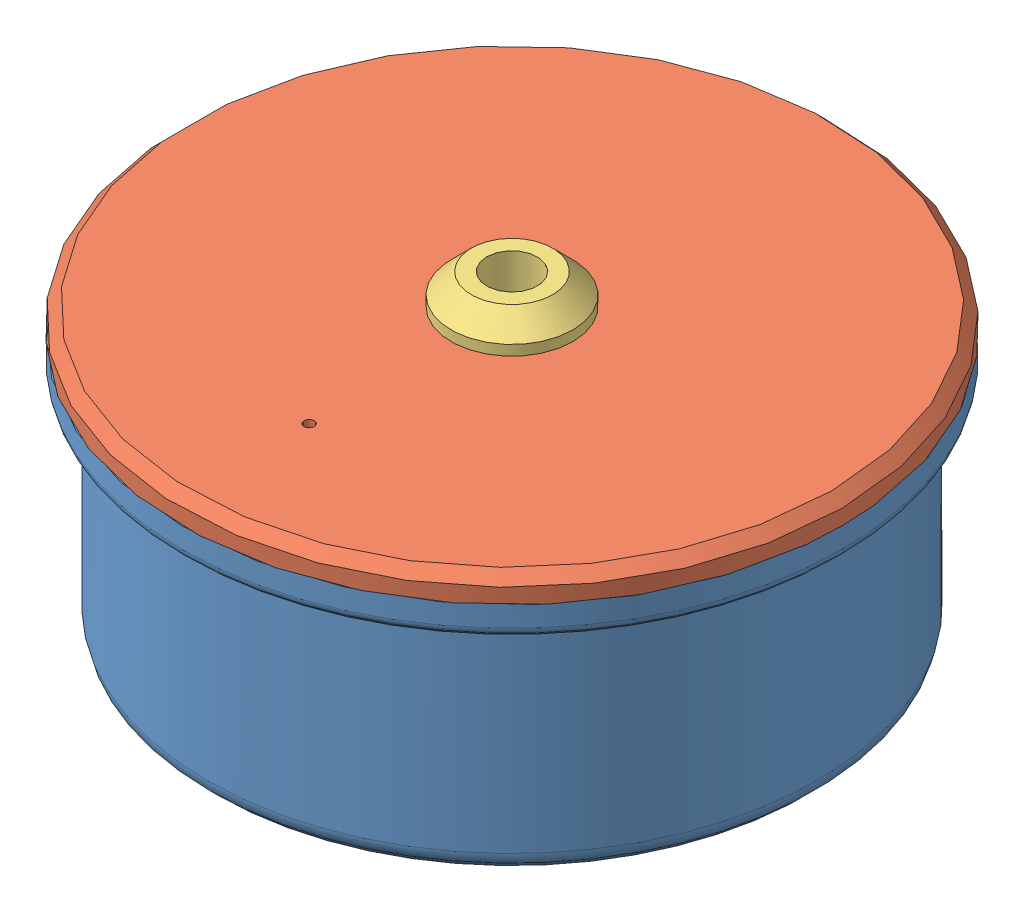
SolidWorks assembly MOTEUR STIRLING_91700.SLDASM, configuration Default (file format 10000). Lengths in mm.
Overall size (65 30.5 65).
3 component instances, 3 part files, 4 mates.
Components (placement in the parent):
- POT EN VERRE-1: POT EN VERRE.SLDPRT [Default] at (21.1954 19.121 52.0241) size (65 25 65)
- COUVERCLE-1: COUVERCLE.SLDPRT [Default] at (21.1954 46.621 52.0241) x (1 0 0) z (0 -1 0) size (65 65 4.5)
- SUPPORT DE MECHE-1: SUPPORT DE MECHE.SLDPRT [Default] at (21.1954 46.621 52.0241) x (1 0 0.000672) z (0 -1 0) size (12 12 8)
Mates (geometry in assembly coordinates):
- Coaxiale1: concentric aligned: cylinder of POT EN VERRE-1 through (21.1954 73.3149 52.0241) axis (0 1 0) radius 27.5; cylinder of COUVERCLE-1 through (21.1954 44.121 52.0241) axis (0 1 0) radius 32.5
- Coïncidente1: coincident anti-aligned: plane of POT EN VERRE-1 through (53.6954 44.121 52.0241) normal (0 1 0); plane of COUVERCLE-1 through (21.1954 44.121 52.0241) normal (0 -1 0)
- Coaxiale2: concentric aligned: cylinder of COUVERCLE-1 through (21.1954 46.621 52.0241) axis (0 1 0) radius 4; cylinder of SUPPORT DE MECHE-1 through (21.1954 41.621 52.0241) axis (0 1 0) radius 4
- Coïncidente3: coincident anti-aligned: plane of COUVERCLE-1 through (21.1954 46.621 52.0241) normal (0 1 0); plane of SUPPORT DE MECHE-1 through (21.1954 46.621 52.0241) normal (0 -1 0)
